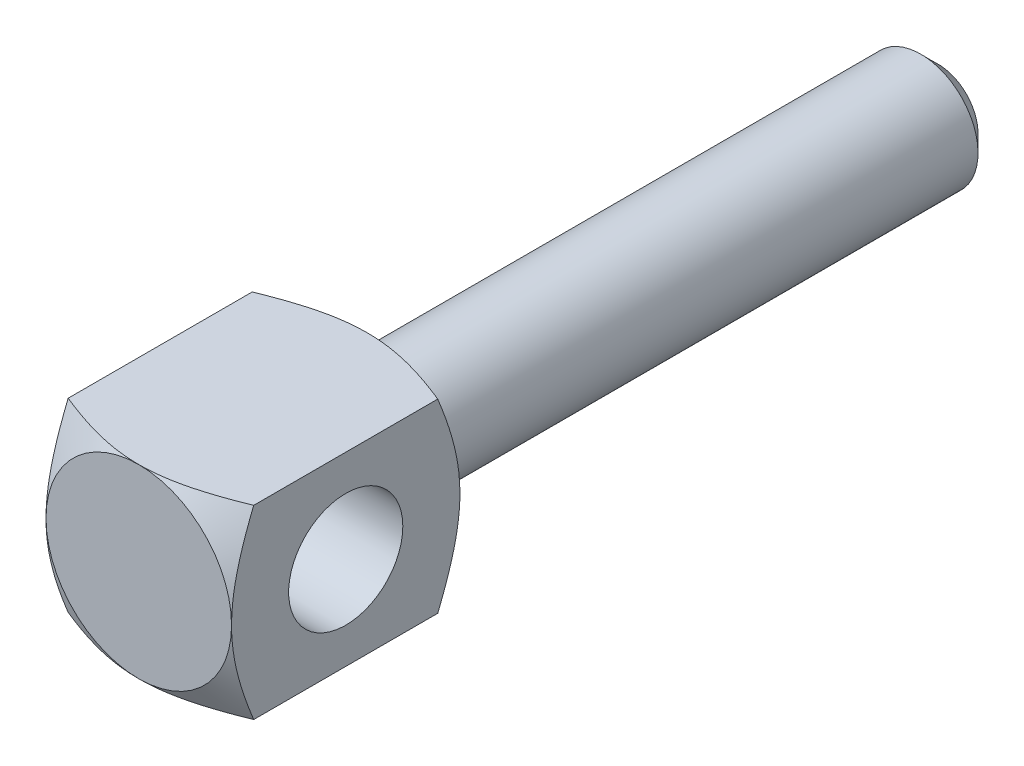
ISO-10303-21;
HEADER;
FILE_DESCRIPTION(('STEP AP214'),'2;1');
FILE_NAME('part.step','',(''),(''),'','','');
FILE_SCHEMA(('AUTOMOTIVE_DESIGN { 1 0 10303 214 1 1 1 1 }'));
ENDSEC;
DATA;
#1=APPLICATION_CONTEXT('core data for automotive mechanical design processes');
#2=APPLICATION_PROTOCOL_DEFINITION('international standard','automotive_design',2000,#1);
#3=PRODUCT_CONTEXT('',#1,'mechanical');
#4=PRODUCT('Part','Part','',(#3));
#5=PRODUCT_RELATED_PRODUCT_CATEGORY('part','',(#4));
#6=PRODUCT_DEFINITION_FORMATION('','',#4);
#7=PRODUCT_DEFINITION_CONTEXT('part definition',#1,'design');
#8=PRODUCT_DEFINITION('design','',#6,#7);
#9=PRODUCT_DEFINITION_SHAPE('','',#8);
#10=(LENGTH_UNIT() NAMED_UNIT(*) SI_UNIT(.MILLI.,.METRE.));
#11=(NAMED_UNIT(*) PLANE_ANGLE_UNIT() SI_UNIT($,.RADIAN.));
#12=(NAMED_UNIT(*) SI_UNIT($,.STERADIAN.) SOLID_ANGLE_UNIT());
#13=UNCERTAINTY_MEASURE_WITH_UNIT(LENGTH_MEASURE(1.E-05),#10,'distance_accuracy_value','');
#14=(GEOMETRIC_REPRESENTATION_CONTEXT(3) GLOBAL_UNCERTAINTY_ASSIGNED_CONTEXT((#13)) GLOBAL_UNIT_ASSIGNED_CONTEXT((#10,
#11,#12)) REPRESENTATION_CONTEXT('',''));
#15=CARTESIAN_POINT('',(0.,0.,0.));
#16=DIRECTION('',(0.,0.,1.));
#17=DIRECTION('',(1.,0.,0.));
#18=AXIS2_PLACEMENT_3D('',#15,#16,#17);
#19=CARTESIAN_POINT('',(0.,-4.,40.));
#20=DIRECTION('',(0.,0.,1.));
#21=DIRECTION('',(0.,-1.,0.));
#22=AXIS2_PLACEMENT_3D('',#19,#20,#21);
#23=PLANE('',#22);
#24=CARTESIAN_POINT('',(0.,0.,40.));
#25=DIRECTION('',(0.,0.,1.));
#26=DIRECTION('',(0.,-1.,0.));
#27=AXIS2_PLACEMENT_3D('',#24,#25,#26);
#28=CIRCLE('',#27,4.);
#29=CARTESIAN_POINT('',(0.,-4.,40.));
#30=VERTEX_POINT('',#29);
#31=EDGE_CURVE('E191',#30,#30,#28,.T.);
#32=ORIENTED_EDGE('',*,*,#31,.T.);
#33=EDGE_LOOP('',(#32));
#34=FACE_BOUND('',#33,.T.);
#35=CARTESIAN_POINT('',(0.,0.,40.));
#36=DIRECTION('',(0.,0.,1.));
#37=DIRECTION('',(0.,-1.,0.));
#38=AXIS2_PLACEMENT_3D('',#35,#36,#37);
#39=CIRCLE('',#38,6.5);
#40=CARTESIAN_POINT('',(0.,-6.5,40.));
#41=VERTEX_POINT('',#40);
#42=CARTESIAN_POINT('',(6.5,0.,40.));
#43=VERTEX_POINT('',#42);
#44=EDGE_CURVE('E82',#41,#43,#39,.T.);
#45=ORIENTED_EDGE('',*,*,#44,.F.);
#46=CARTESIAN_POINT('',(0.,0.,40.));
#47=DIRECTION('',(0.,0.,1.));
#48=DIRECTION('',(0.,-1.,0.));
#49=AXIS2_PLACEMENT_3D('',#46,#47,#48);
#50=CIRCLE('',#49,6.5);
#51=CARTESIAN_POINT('',(-6.5,0.,40.));
#52=VERTEX_POINT('',#51);
#53=EDGE_CURVE('E18',#52,#41,#50,.T.);
#54=ORIENTED_EDGE('',*,*,#53,.F.);
#55=CARTESIAN_POINT('',(0.,6.5,40.));
#56=VERTEX_POINT('',#55);
#57=EDGE_CURVE('E23',#56,#52,#50,.T.);
#58=ORIENTED_EDGE('',*,*,#57,.F.);
#59=EDGE_CURVE('E9',#43,#56,#50,.T.);
#60=ORIENTED_EDGE('',*,*,#59,.F.);
#61=EDGE_LOOP('',(#45,#54,#58,#60));
#62=FACE_BOUND('',#61,.T.);
#63=ADVANCED_FACE('F14',(#34,#62),#23,.F.);
#64=CARTESIAN_POINT('',(0.,0.,0.));
#65=DIRECTION('',(0.,0.,1.));
#66=DIRECTION('',(0.,-1.,0.));
#67=AXIS2_PLACEMENT_3D('',#64,#65,#66);
#68=PLANE('',#67);
#69=CARTESIAN_POINT('',(0.,0.,0.));
#70=DIRECTION('',(0.,0.,1.));
#71=DIRECTION('',(0.,-1.,0.));
#72=AXIS2_PLACEMENT_3D('',#69,#70,#71);
#73=CIRCLE('',#72,2.8);
#74=CARTESIAN_POINT('',(0.,-2.8,0.));
#75=VERTEX_POINT('',#74);
#76=EDGE_CURVE('E197',#75,#75,#73,.T.);
#77=ORIENTED_EDGE('',*,*,#76,.F.);
#78=EDGE_LOOP('',(#77));
#79=FACE_BOUND('',#78,.T.);
#80=ADVANCED_FACE('F16',(#79),#68,.F.);
#81=CARTESIAN_POINT('',(0.,0.,1.2));
#82=DIRECTION('',(0.,0.,1.));
#83=DIRECTION('',(0.,-1.,0.));
#84=AXIS2_PLACEMENT_3D('',#81,#82,#83);
#85=CONICAL_SURFACE('',#84,4.,0.785398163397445);
#86=ORIENTED_EDGE('',*,*,#76,.T.);
#87=EDGE_LOOP('',(#86));
#88=FACE_BOUND('',#87,.T.);
#89=CARTESIAN_POINT('',(0.,0.,1.2));
#90=DIRECTION('',(0.,0.,1.));
#91=DIRECTION('',(0.,-1.,0.));
#92=AXIS2_PLACEMENT_3D('',#89,#90,#91);
#93=CIRCLE('',#92,4.);
#94=CARTESIAN_POINT('',(0.,-4.,1.2));
#95=VERTEX_POINT('',#94);
#96=EDGE_CURVE('E194',#95,#95,#93,.T.);
#97=ORIENTED_EDGE('',*,*,#96,.F.);
#98=EDGE_LOOP('',(#97));
#99=FACE_BOUND('',#98,.T.);
#100=ADVANCED_FACE('F251',(#88,#99),#85,.T.);
#101=CARTESIAN_POINT('',(0.,0.,140.));
#102=DIRECTION('',(0.,0.,1.));
#103=DIRECTION('',(0.,-1.,0.));
#104=AXIS2_PLACEMENT_3D('',#101,#102,#103);
#105=CYLINDRICAL_SURFACE('',#104,4.);
#106=ORIENTED_EDGE('',*,*,#31,.F.);
#107=EDGE_LOOP('',(#106));
#108=FACE_BOUND('',#107,.T.);
#109=ORIENTED_EDGE('',*,*,#96,.T.);
#110=EDGE_LOOP('',(#109));
#111=FACE_BOUND('',#110,.T.);
#112=ADVANCED_FACE('F254',(#108,#111),#105,.T.);
#113=CARTESIAN_POINT('',(0.,0.,43.3053832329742));
#114=DIRECTION('',(0.,0.,1.));
#115=DIRECTION('',(0.,-1.,0.));
#116=AXIS2_PLACEMENT_3D('',#113,#114,#115);
#117=CONICAL_SURFACE('',#116,12.2250916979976,1.0471975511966);
#118=CARTESIAN_POINT('',(-13.170806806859,-6.5,44.7270061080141));
#119=CARTESIAN_POINT('',(-12.8513212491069,-6.5,44.5616223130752));
#120=CARTESIAN_POINT('',(-12.531370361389,-6.5,44.3971290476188));
#121=CARTESIAN_POINT('',(-11.8902968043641,-6.5,44.0703971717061));
#122=CARTESIAN_POINT('',(-11.5691740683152,-6.5,43.9081586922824));
#123=CARTESIAN_POINT('',(-10.9248596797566,-6.5,43.5860828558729));
#124=CARTESIAN_POINT('',(-10.6016650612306,-6.5,43.4262514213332));
#125=CARTESIAN_POINT('',(-9.95360392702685,-6.5,43.1100264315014));
#126=CARTESIAN_POINT('',(-9.6287374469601,-6.5,42.9536328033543));
#127=CARTESIAN_POINT('',(-8.95837578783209,-6.5,42.6363684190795));
#128=CARTESIAN_POINT('',(-8.61276045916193,-6.5,42.4757507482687));
#129=CARTESIAN_POINT('',(-7.91866608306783,-6.5,42.1607447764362));
#130=CARTESIAN_POINT('',(-7.57018686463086,-6.5,42.0063568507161));
#131=CARTESIAN_POINT('',(-6.86996890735,-6.5,41.7059043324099));
#132=CARTESIAN_POINT('',(-6.51823300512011,-6.5,41.5598331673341));
#133=CARTESIAN_POINT('',(-5.81043935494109,-6.5,41.2786319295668));
#134=CARTESIAN_POINT('',(-5.4543822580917,-6.5,41.1435002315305));
#135=CARTESIAN_POINT('',(-4.74112513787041,-6.5,40.8894360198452));
#136=CARTESIAN_POINT('',(-4.38398639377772,-6.5,40.7703336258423));
#137=CARTESIAN_POINT('',(-3.66372876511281,-6.5,40.5514514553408));
#138=CARTESIAN_POINT('',(-3.30060960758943,-6.5,40.4516725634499));
#139=CARTESIAN_POINT('',(-2.57544214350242,-6.5,40.279438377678));
#140=CARTESIAN_POINT('',(-2.21351869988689,-6.5,40.2064747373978));
#141=CARTESIAN_POINT('',(-1.66702381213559,-6.5,40.1201289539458));
#142=CARTESIAN_POINT('',(-1.484252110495,-6.5,40.0951966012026));
#143=CARTESIAN_POINT('',(-1.1177718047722,-6.5,40.053671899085));
#144=CARTESIAN_POINT('',(-0.934063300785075,-6.5,40.037078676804));
#145=CARTESIAN_POINT('',(-0.522805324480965,-6.5,40.0098650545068));
#146=CARTESIAN_POINT('',(-0.295097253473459,-6.5,40.0015642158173));
#147=CARTESIAN_POINT('',(0.160406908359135,-6.5,39.9988386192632));
#148=CARTESIAN_POINT('',(0.388203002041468,-6.5,40.0044143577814));
#149=CARTESIAN_POINT('',(0.843089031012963,-6.5,40.0291762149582));
#150=CARTESIAN_POINT('',(1.07017882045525,-6.5,40.0483649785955));
#151=CARTESIAN_POINT('',(1.52290639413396,-6.5,40.0994923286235));
#152=CARTESIAN_POINT('',(1.74854412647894,-6.5,40.1314313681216));
#153=CARTESIAN_POINT('',(2.20428872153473,-6.5,40.2078615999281));
#154=CARTESIAN_POINT('',(2.43433924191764,-6.5,40.2526851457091));
#155=CARTESIAN_POINT('',(2.89211105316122,-6.5,40.3528868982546));
#156=CARTESIAN_POINT('',(3.11983228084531,-6.5,40.4082653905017));
#157=CARTESIAN_POINT('',(3.57301250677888,-6.5,40.5280247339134));
#158=CARTESIAN_POINT('',(3.79847016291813,-6.5,40.5924106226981));
#159=CARTESIAN_POINT('',(4.24706573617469,-6.5,40.7287122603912));
#160=CARTESIAN_POINT('',(4.47020378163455,-6.5,40.8006275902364));
#161=CARTESIAN_POINT('',(5.08998498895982,-6.5,41.0100529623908));
#162=CARTESIAN_POINT('',(5.48429388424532,-6.5,41.1544621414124));
#163=CARTESIAN_POINT('',(6.26737962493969,-6.5,41.4576558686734));
#164=CARTESIAN_POINT('',(6.65615488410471,-6.5,41.6164444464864));
#165=CARTESIAN_POINT('',(7.4296178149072,-6.5,41.9446033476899));
#166=CARTESIAN_POINT('',(7.8143013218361,-6.5,42.1139834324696));
#167=CARTESIAN_POINT('',(8.58012081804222,-6.5,42.4604337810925));
#168=CARTESIAN_POINT('',(8.96125717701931,-6.5,42.6375032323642));
#169=CARTESIAN_POINT('',(9.72196205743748,-6.5,42.998007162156));
#170=CARTESIAN_POINT('',(10.101521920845,-6.5,43.1814598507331));
#171=CARTESIAN_POINT('',(10.8584497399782,-6.5,43.5528416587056));
#172=CARTESIAN_POINT('',(11.2358176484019,-6.5,43.7407708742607));
#173=CARTESIAN_POINT('',(11.988592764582,-6.5,44.1200158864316));
#174=CARTESIAN_POINT('',(12.3640009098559,-6.5,44.3113298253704));
#175=CARTESIAN_POINT('',(13.1133899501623,-6.5,44.6967216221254));
#176=CARTESIAN_POINT('',(13.4873708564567,-6.5,44.8907994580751));
#177=CARTESIAN_POINT('',(14.5067202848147,-6.5,45.4236307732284));
#178=CARTESIAN_POINT('',(15.150936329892,-6.5,45.7645880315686));
#179=CARTESIAN_POINT('',(16.4369696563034,-6.5,46.4512157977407));
#180=CARTESIAN_POINT('',(17.0787865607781,-6.5,46.796887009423));
#181=CARTESIAN_POINT('',(18.3563784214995,-6.5,47.4893845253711));
#182=CARTESIAN_POINT('',(18.9921654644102,-6.5,47.8361885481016));
#183=CARTESIAN_POINT('',(19.9447415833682,-6.5,48.3582763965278));
#184=CARTESIAN_POINT('',(20.2620554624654,-6.5,48.5326041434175));
#185=CARTESIAN_POINT('',(20.8963727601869,-6.5,48.8818223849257));
#186=CARTESIAN_POINT('',(21.2133761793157,-6.5,49.0567128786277));
#187=CARTESIAN_POINT('',(21.5302445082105,-6.5,49.2318478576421));
#188=B_SPLINE_CURVE_WITH_KNOTS('',3,(#118,#119,#120,#121,#122,#123,#124,#125,#126,#127,#128,
#129,#130,#131,#132,#133,#134,#135,#136,#137,#138,#139,#140,#141,#142,#143,#144,#145,#146,#147,
#148,#149,#150,#151,#152,#153,#154,#155,#156,#157,#158,#159,#160,#161,#162,#163,#164,#165,#166,
#167,#168,#169,#170,#171,#172,#173,#174,#175,#176,#177,#178,#179,#180,#181,#182,#183,#184,#185,
#186,#187),.UNSPECIFIED.,.F.,.F.,(4,2,2,2,2,2,2,2,2,2,2,2,2,2,2,2,2,2,2,2,2,2,2,2,2,2,2,2,2,2,2,
2,2,2,4),(0.,1.07926585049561,2.15859416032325,3.24024653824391,4.32187597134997,
5.46517113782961,6.6085350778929,7.75098253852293,8.89325994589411,10.022273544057,
11.1513388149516,12.2577363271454,12.8109657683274,13.3641372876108,14.0472875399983,
14.7304622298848,15.4137696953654,16.0971014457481,16.7999437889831,17.5028051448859,
18.2060611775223,18.9092780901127,20.1685968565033,21.428269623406,22.6891209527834,
23.9498393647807,25.2145091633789,26.4792061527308,27.7432293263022,29.0072425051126,
31.1938518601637,33.3807913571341,35.553450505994,36.6395920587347,37.7257318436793),.UNSPECIFIED.);
#189=CARTESIAN_POINT('',(-6.5,-6.5,41.5544510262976));
#190=VERTEX_POINT('',#189);
#191=EDGE_CURVE('E89',#41,#190,#188,.F.);
#192=ORIENTED_EDGE('',*,*,#191,.T.);
#193=CARTESIAN_POINT('',(-6.5,13.170806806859,44.7270061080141));
#194=CARTESIAN_POINT('',(-6.5,12.8513212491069,44.5616223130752));
#195=CARTESIAN_POINT('',(-6.5,12.531370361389,44.3971290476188));
#196=CARTESIAN_POINT('',(-6.5,11.8902968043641,44.0703971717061));
#197=CARTESIAN_POINT('',(-6.5,11.5691740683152,43.9081586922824));
#198=CARTESIAN_POINT('',(-6.5,10.9248596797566,43.5860828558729));
#199=CARTESIAN_POINT('',(-6.5,10.6016650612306,43.4262514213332));
#200=CARTESIAN_POINT('',(-6.5,9.95360392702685,43.1100264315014));
#201=CARTESIAN_POINT('',(-6.5,9.62873744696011,42.9536328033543));
#202=CARTESIAN_POINT('',(-6.5,8.9583757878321,42.6363684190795));
#203=CARTESIAN_POINT('',(-6.5,8.61276045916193,42.4757507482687));
#204=CARTESIAN_POINT('',(-6.5,7.91866608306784,42.1607447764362));
#205=CARTESIAN_POINT('',(-6.5,7.57018686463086,42.0063568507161));
#206=CARTESIAN_POINT('',(-6.5,6.86996890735,41.7059043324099));
#207=CARTESIAN_POINT('',(-6.5,6.51823300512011,41.5598331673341));
#208=CARTESIAN_POINT('',(-6.5,5.8104393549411,41.2786319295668));
#209=CARTESIAN_POINT('',(-6.5,5.4543822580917,41.1435002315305));
#210=CARTESIAN_POINT('',(-6.5,4.74112513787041,40.8894360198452));
#211=CARTESIAN_POINT('',(-6.5,4.38398639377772,40.7703336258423));
#212=CARTESIAN_POINT('',(-6.5,3.66372876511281,40.5514514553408));
#213=CARTESIAN_POINT('',(-6.5,3.30060960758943,40.4516725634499));
#214=CARTESIAN_POINT('',(-6.5,2.57544214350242,40.279438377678));
#215=CARTESIAN_POINT('',(-6.5,2.21351869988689,40.2064747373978));
#216=CARTESIAN_POINT('',(-6.5,1.66702381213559,40.1201289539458));
#217=CARTESIAN_POINT('',(-6.5,1.484252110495,40.0951966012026));
#218=CARTESIAN_POINT('',(-6.5,1.1177718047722,40.053671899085));
#219=CARTESIAN_POINT('',(-6.5,0.934063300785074,40.037078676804));
#220=CARTESIAN_POINT('',(-6.5,0.522805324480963,40.0098650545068));
#221=CARTESIAN_POINT('',(-6.5,0.295097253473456,40.0015642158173));
#222=CARTESIAN_POINT('',(-6.5,-0.16040690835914,39.9988386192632));
#223=CARTESIAN_POINT('',(-6.5,-0.388203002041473,40.0044143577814));
#224=CARTESIAN_POINT('',(-6.5,-0.843089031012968,40.0291762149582));
#225=CARTESIAN_POINT('',(-6.5,-1.07017882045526,40.0483649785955));
#226=CARTESIAN_POINT('',(-6.5,-1.52290639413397,40.0994923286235));
#227=CARTESIAN_POINT('',(-6.5,-1.74854412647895,40.1314313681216));
#228=CARTESIAN_POINT('',(-6.5,-2.20428872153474,40.2078615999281));
#229=CARTESIAN_POINT('',(-6.5,-2.43433924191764,40.2526851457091));
#230=CARTESIAN_POINT('',(-6.5,-2.89211105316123,40.3528868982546));
#231=CARTESIAN_POINT('',(-6.5,-3.11983228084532,40.4082653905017));
#232=CARTESIAN_POINT('',(-6.5,-3.57301250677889,40.5280247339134));
#233=CARTESIAN_POINT('',(-6.5,-3.79847016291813,40.5924106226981));
#234=CARTESIAN_POINT('',(-6.5,-4.2470657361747,40.7287122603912));
#235=CARTESIAN_POINT('',(-6.5,-4.47020378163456,40.8006275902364));
#236=CARTESIAN_POINT('',(-6.5,-5.08998498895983,41.0100529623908));
#237=CARTESIAN_POINT('',(-6.5,-5.48429388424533,41.1544621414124));
#238=CARTESIAN_POINT('',(-6.5,-6.2673796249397,41.4576558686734));
#239=CARTESIAN_POINT('',(-6.5,-6.65615488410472,41.6164444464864));
#240=CARTESIAN_POINT('',(-6.5,-7.42961781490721,41.9446033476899));
#241=CARTESIAN_POINT('',(-6.5,-7.81430132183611,42.1139834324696));
#242=CARTESIAN_POINT('',(-6.5,-8.58012081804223,42.4604337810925));
#243=CARTESIAN_POINT('',(-6.5,-8.96125717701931,42.6375032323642));
#244=CARTESIAN_POINT('',(-6.5,-9.72196205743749,42.998007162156));
#245=CARTESIAN_POINT('',(-6.5,-10.101521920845,43.1814598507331));
#246=CARTESIAN_POINT('',(-6.5,-10.8584497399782,43.5528416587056));
#247=CARTESIAN_POINT('',(-6.5,-11.2358176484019,43.7407708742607));
#248=CARTESIAN_POINT('',(-6.5,-11.988592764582,44.1200158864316));
#249=CARTESIAN_POINT('',(-6.5,-12.3640009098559,44.3113298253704));
#250=CARTESIAN_POINT('',(-6.5,-13.1133899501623,44.6967216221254));
#251=CARTESIAN_POINT('',(-6.5,-13.4873708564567,44.8907994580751));
#252=CARTESIAN_POINT('',(-6.5,-14.5067202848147,45.4236307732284));
#253=CARTESIAN_POINT('',(-6.5,-15.150936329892,45.7645880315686));
#254=CARTESIAN_POINT('',(-6.5,-16.4369696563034,46.4512157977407));
#255=CARTESIAN_POINT('',(-6.5,-17.0787865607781,46.796887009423));
#256=CARTESIAN_POINT('',(-6.5,-18.3563784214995,47.4893845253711));
#257=CARTESIAN_POINT('',(-6.5,-18.9921654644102,47.8361885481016));
#258=CARTESIAN_POINT('',(-6.5,-19.9447415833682,48.3582763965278));
#259=CARTESIAN_POINT('',(-6.5,-20.2620554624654,48.5326041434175));
#260=CARTESIAN_POINT('',(-6.5,-20.8963727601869,48.8818223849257));
#261=CARTESIAN_POINT('',(-6.5,-21.2133761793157,49.0567128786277));
#262=CARTESIAN_POINT('',(-6.5,-21.5302445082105,49.2318478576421));
#263=B_SPLINE_CURVE_WITH_KNOTS('',3,(#193,#194,#195,#196,#197,#198,#199,#200,#201,#202,#203,
#204,#205,#206,#207,#208,#209,#210,#211,#212,#213,#214,#215,#216,#217,#218,#219,#220,#221,#222,
#223,#224,#225,#226,#227,#228,#229,#230,#231,#232,#233,#234,#235,#236,#237,#238,#239,#240,#241,
#242,#243,#244,#245,#246,#247,#248,#249,#250,#251,#252,#253,#254,#255,#256,#257,#258,#259,#260,
#261,#262),.UNSPECIFIED.,.F.,.F.,(4,2,2,2,2,2,2,2,2,2,2,2,2,2,2,2,2,2,2,2,2,2,2,2,2,2,2,2,2,2,2,
2,2,2,4),(0.,1.07926585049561,2.15859416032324,3.24024653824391,4.32187597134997,
5.4651711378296,6.6085350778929,7.75098253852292,8.89325994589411,10.022273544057,
11.1513388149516,12.2577363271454,12.8109657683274,13.3641372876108,14.0472875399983,
14.7304622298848,15.4137696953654,16.0971014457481,16.7999437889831,17.5028051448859,
18.2060611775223,18.9092780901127,20.1685968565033,21.428269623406,22.6891209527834,
23.9498393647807,25.214509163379,26.4792061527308,27.7432293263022,29.0072425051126,
31.1938518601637,33.3807913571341,35.553450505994,36.6395920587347,37.7257318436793),.UNSPECIFIED.);
#264=EDGE_CURVE('E96',#52,#190,#263,.T.);
#265=ORIENTED_EDGE('',*,*,#264,.F.);
#266=ORIENTED_EDGE('',*,*,#53,.T.);
#267=EDGE_LOOP('',(#192,#265,#266));
#268=FACE_BOUND('',#267,.T.);
#269=ADVANCED_FACE('F94',(#268),#117,.T.);
#270=ORIENTED_EDGE('',*,*,#57,.T.);
#271=CARTESIAN_POINT('',(-6.5,6.5,41.5544510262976));
#272=VERTEX_POINT('',#271);
#273=EDGE_CURVE('E106',#272,#52,#263,.T.);
#274=ORIENTED_EDGE('',*,*,#273,.F.);
#275=CARTESIAN_POINT('',(-13.17080681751,6.5,44.7270061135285));
#276=CARTESIAN_POINT('',(-12.8513212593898,6.5,44.5616223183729));
#277=CARTESIAN_POINT('',(-12.5313703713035,6.5,44.3971290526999));
#278=CARTESIAN_POINT('',(-11.8902968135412,6.5,44.070397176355));
#279=CARTESIAN_POINT('',(-11.5691740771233,6.5,43.9081586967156));
#280=CARTESIAN_POINT('',(-10.9248596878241,6.5,43.5860828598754));
#281=CARTESIAN_POINT('',(-10.6016650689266,6.5,43.4262514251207));
#282=CARTESIAN_POINT('',(-9.95360393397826,6.5,43.1100264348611));
#283=CARTESIAN_POINT('',(-9.6287374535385,6.5,42.9536328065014));
#284=CARTESIAN_POINT('',(-8.95837579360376,6.5,42.6363684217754));
#285=CARTESIAN_POINT('',(-8.61276046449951,6.5,42.4757507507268));
#286=CARTESIAN_POINT('',(-7.91866608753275,6.5,42.1607447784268));
#287=CARTESIAN_POINT('',(-7.5701868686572,6.5,42.0063568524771));
#288=CARTESIAN_POINT('',(-6.86996891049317,6.5,41.7059043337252));
#289=CARTESIAN_POINT('',(-6.5182330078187,6.5,41.5598331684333));
#290=CARTESIAN_POINT('',(-5.81043935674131,6.5,41.278631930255));
#291=CARTESIAN_POINT('',(-5.45438225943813,6.5,41.1435002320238));
#292=CARTESIAN_POINT('',(-4.74112513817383,6.5,40.8894360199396));
#293=CARTESIAN_POINT('',(-4.38398639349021,6.5,40.7703336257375));
#294=CARTESIAN_POINT('',(-3.66372876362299,6.5,40.5514514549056));
#295=CARTESIAN_POINT('',(-3.30060960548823,6.5,40.4516725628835));
#296=CARTESIAN_POINT('',(-2.57544214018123,6.5,40.2794383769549));
#297=CARTESIAN_POINT('',(-2.21351869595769,6.5,40.2064747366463));
#298=CARTESIAN_POINT('',(-1.66702380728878,6.5,40.1201289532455));
#299=CARTESIAN_POINT('',(-1.48425210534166,6.5,40.0951966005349));
#300=CARTESIAN_POINT('',(-1.11777179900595,6.5,40.0536718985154));
#301=CARTESIAN_POINT('',(-0.934063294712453,6.5,40.0370786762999));
#302=CARTESIAN_POINT('',(-0.522805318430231,6.5,40.0098650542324));
#303=CARTESIAN_POINT('',(-0.29509724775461,6.5,40.0015642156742));
#304=CARTESIAN_POINT('',(0.160406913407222,6.5,39.9988386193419));
#305=CARTESIAN_POINT('',(0.388203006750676,6.5,40.0044143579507));
#306=CARTESIAN_POINT('',(0.843089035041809,6.5,40.0291762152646));
#307=CARTESIAN_POINT('',(1.07017882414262,6.5,40.0483649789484));
#308=CARTESIAN_POINT('',(1.5229063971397,6.5,40.0994923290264));
#309=CARTESIAN_POINT('',(1.74854412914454,6.5,40.1314313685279));
#310=CARTESIAN_POINT('',(2.2042887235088,6.5,40.207861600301));
#311=CARTESIAN_POINT('',(2.43433924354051,6.5,40.2526851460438));
#312=CARTESIAN_POINT('',(2.89211105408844,6.5,40.3528868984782));
#313=CARTESIAN_POINT('',(3.11983228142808,6.5,40.4082653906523));
#314=CARTESIAN_POINT('',(3.57301250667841,6.5,40.5280247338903));
#315=CARTESIAN_POINT('',(3.79847016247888,6.5,40.5924106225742));
#316=CARTESIAN_POINT('',(4.24706573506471,6.5,40.7287122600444));
#317=CARTESIAN_POINT('',(4.47020378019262,6.5,40.8006275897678));
#318=CARTESIAN_POINT('',(5.08998498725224,6.5,41.0100529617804));
#319=CARTESIAN_POINT('',(5.48429388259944,6.5,41.1544621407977));
#320=CARTESIAN_POINT('',(6.26737962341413,6.5,41.4576558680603));
#321=CARTESIAN_POINT('',(6.65615488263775,6.5,41.6164444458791));
#322=CARTESIAN_POINT('',(7.42961781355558,6.5,41.9446033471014));
#323=CARTESIAN_POINT('',(7.81430132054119,6.5,42.1139834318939));
#324=CARTESIAN_POINT('',(8.5801208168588,6.5,42.460433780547));
#325=CARTESIAN_POINT('',(8.96125717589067,6.5,42.6375032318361));
#326=CARTESIAN_POINT('',(9.72196205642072,6.5,42.9980071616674));
#327=CARTESIAN_POINT('',(10.1015219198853,6.5,43.1814598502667));
#328=CARTESIAN_POINT('',(10.8584497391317,6.5,43.5528416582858));
#329=CARTESIAN_POINT('',(11.2358176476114,6.5,43.7407708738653));
#330=CARTESIAN_POINT('',(11.9885927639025,6.5,44.1200158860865));
#331=CARTESIAN_POINT('',(12.3640009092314,6.5,44.3113298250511));
#332=CARTESIAN_POINT('',(13.1133899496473,6.5,44.6967216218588));
#333=CARTESIAN_POINT('',(13.4873708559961,6.5,44.8907994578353));
#334=CARTESIAN_POINT('',(14.5067202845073,6.5,45.4236307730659));
#335=CARTESIAN_POINT('',(15.150936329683,6.5,45.7645880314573));
#336=CARTESIAN_POINT('',(16.4369696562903,6.5,46.4512157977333));
#337=CARTESIAN_POINT('',(17.0787865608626,6.5,46.7968870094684));
#338=CARTESIAN_POINT('',(18.3563784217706,6.5,47.4893845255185));
#339=CARTESIAN_POINT('',(18.9921654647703,6.5,47.8361885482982));
#340=CARTESIAN_POINT('',(19.9447415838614,6.5,48.3582763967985));
#341=CARTESIAN_POINT('',(20.2620554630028,6.5,48.532604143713));
#342=CARTESIAN_POINT('',(20.8963727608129,6.5,48.8818223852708));
#343=CARTESIAN_POINT('',(21.2133761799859,6.5,49.0567128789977));
#344=CARTESIAN_POINT('',(21.5302445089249,6.5,49.231847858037));
#345=B_SPLINE_CURVE_WITH_KNOTS('',3,(#275,#276,#277,#278,#279,#280,#281,#282,#283,#284,#285,
#286,#287,#288,#289,#290,#291,#292,#293,#294,#295,#296,#297,#298,#299,#300,#301,#302,#303,#304,
#305,#306,#307,#308,#309,#310,#311,#312,#313,#314,#315,#316,#317,#318,#319,#320,#321,#322,#323,
#324,#325,#326,#327,#328,#329,#330,#331,#332,#333,#334,#335,#336,#337,#338,#339,#340,#341,#342,
#343,#344),.UNSPECIFIED.,.F.,.F.,(4,2,2,2,2,2,2,2,2,2,2,2,2,2,2,2,2,2,2,2,2,2,2,2,2,2,2,2,2,2,2,
2,2,2,4),(0.,1.07926585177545,2.158594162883,3.24024654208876,4.32187597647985,5.46517114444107,
6.60853508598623,7.75098254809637,8.89325995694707,10.0222735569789,11.1513388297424,
12.2577363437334,12.8109657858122,13.3641373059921,14.0472875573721,14.7304622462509,
15.4137697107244,16.0971014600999,16.7999438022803,17.5028051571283,18.206061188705,
18.9092781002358,20.1685968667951,21.4282696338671,22.6891209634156,23.9498393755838,
25.2145091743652,26.4792061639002,27.7432293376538,29.0072425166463,31.1938518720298,
33.3807913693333,35.5534505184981,36.639592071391,37.7257318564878),.UNSPECIFIED.);
#346=EDGE_CURVE('E37',#56,#272,#345,.F.);
#347=ORIENTED_EDGE('',*,*,#346,.F.);
#348=EDGE_LOOP('',(#270,#274,#347));
#349=FACE_BOUND('',#348,.T.);
#350=ADVANCED_FACE('F126',(#349),#117,.T.);
#351=CARTESIAN_POINT('',(6.5,13.170806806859,44.7270061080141));
#352=CARTESIAN_POINT('',(6.5,12.8513212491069,44.5616223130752));
#353=CARTESIAN_POINT('',(6.5,12.531370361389,44.3971290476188));
#354=CARTESIAN_POINT('',(6.5,11.8902968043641,44.0703971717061));
#355=CARTESIAN_POINT('',(6.5,11.5691740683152,43.9081586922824));
#356=CARTESIAN_POINT('',(6.5,10.9248596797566,43.5860828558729));
#357=CARTESIAN_POINT('',(6.5,10.6016650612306,43.4262514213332));
#358=CARTESIAN_POINT('',(6.5,9.95360392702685,43.1100264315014));
#359=CARTESIAN_POINT('',(6.5,9.62873744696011,42.9536328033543));
#360=CARTESIAN_POINT('',(6.5,8.9583757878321,42.6363684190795));
#361=CARTESIAN_POINT('',(6.5,8.61276045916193,42.4757507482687));
#362=CARTESIAN_POINT('',(6.5,7.91866608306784,42.1607447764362));
#363=CARTESIAN_POINT('',(6.5,7.57018686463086,42.0063568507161));
#364=CARTESIAN_POINT('',(6.5,6.86996890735,41.7059043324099));
#365=CARTESIAN_POINT('',(6.5,6.51823300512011,41.5598331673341));
#366=CARTESIAN_POINT('',(6.5,5.8104393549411,41.2786319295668));
#367=CARTESIAN_POINT('',(6.5,5.4543822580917,41.1435002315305));
#368=CARTESIAN_POINT('',(6.5,4.74112513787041,40.8894360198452));
#369=CARTESIAN_POINT('',(6.5,4.38398639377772,40.7703336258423));
#370=CARTESIAN_POINT('',(6.5,3.66372876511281,40.5514514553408));
#371=CARTESIAN_POINT('',(6.5,3.30060960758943,40.4516725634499));
#372=CARTESIAN_POINT('',(6.5,2.57544214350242,40.279438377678));
#373=CARTESIAN_POINT('',(6.5,2.21351869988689,40.2064747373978));
#374=CARTESIAN_POINT('',(6.5,1.66702381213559,40.1201289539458));
#375=CARTESIAN_POINT('',(6.5,1.484252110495,40.0951966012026));
#376=CARTESIAN_POINT('',(6.5,1.1177718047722,40.053671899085));
#377=CARTESIAN_POINT('',(6.5,0.934063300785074,40.037078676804));
#378=CARTESIAN_POINT('',(6.5,0.522805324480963,40.0098650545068));
#379=CARTESIAN_POINT('',(6.5,0.295097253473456,40.0015642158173));
#380=CARTESIAN_POINT('',(6.5,-0.16040690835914,39.9988386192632));
#381=CARTESIAN_POINT('',(6.5,-0.388203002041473,40.0044143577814));
#382=CARTESIAN_POINT('',(6.5,-0.843089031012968,40.0291762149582));
#383=CARTESIAN_POINT('',(6.5,-1.07017882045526,40.0483649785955));
#384=CARTESIAN_POINT('',(6.5,-1.52290639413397,40.0994923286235));
#385=CARTESIAN_POINT('',(6.5,-1.74854412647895,40.1314313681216));
#386=CARTESIAN_POINT('',(6.5,-2.20428872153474,40.2078615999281));
#387=CARTESIAN_POINT('',(6.5,-2.43433924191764,40.2526851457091));
#388=CARTESIAN_POINT('',(6.5,-2.89211105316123,40.3528868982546));
#389=CARTESIAN_POINT('',(6.5,-3.11983228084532,40.4082653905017));
#390=CARTESIAN_POINT('',(6.5,-3.57301250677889,40.5280247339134));
#391=CARTESIAN_POINT('',(6.5,-3.79847016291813,40.5924106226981));
#392=CARTESIAN_POINT('',(6.5,-4.2470657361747,40.7287122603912));
#393=CARTESIAN_POINT('',(6.5,-4.47020378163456,40.8006275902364));
#394=CARTESIAN_POINT('',(6.5,-5.08998498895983,41.0100529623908));
#395=CARTESIAN_POINT('',(6.5,-5.48429388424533,41.1544621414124));
#396=CARTESIAN_POINT('',(6.5,-6.2673796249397,41.4576558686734));
#397=CARTESIAN_POINT('',(6.5,-6.65615488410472,41.6164444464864));
#398=CARTESIAN_POINT('',(6.5,-7.42961781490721,41.9446033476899));
#399=CARTESIAN_POINT('',(6.5,-7.81430132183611,42.1139834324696));
#400=CARTESIAN_POINT('',(6.5,-8.58012081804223,42.4604337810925));
#401=CARTESIAN_POINT('',(6.5,-8.96125717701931,42.6375032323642));
#402=CARTESIAN_POINT('',(6.5,-9.72196205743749,42.998007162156));
#403=CARTESIAN_POINT('',(6.5,-10.101521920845,43.1814598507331));
#404=CARTESIAN_POINT('',(6.5,-10.8584497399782,43.5528416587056));
#405=CARTESIAN_POINT('',(6.5,-11.2358176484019,43.7407708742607));
#406=CARTESIAN_POINT('',(6.5,-11.988592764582,44.1200158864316));
#407=CARTESIAN_POINT('',(6.5,-12.3640009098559,44.3113298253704));
#408=CARTESIAN_POINT('',(6.5,-13.1133899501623,44.6967216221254));
#409=CARTESIAN_POINT('',(6.5,-13.4873708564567,44.8907994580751));
#410=CARTESIAN_POINT('',(6.5,-14.5067202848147,45.4236307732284));
#411=CARTESIAN_POINT('',(6.5,-15.150936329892,45.7645880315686));
#412=CARTESIAN_POINT('',(6.5,-16.4369696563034,46.4512157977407));
#413=CARTESIAN_POINT('',(6.5,-17.0787865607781,46.796887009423));
#414=CARTESIAN_POINT('',(6.5,-18.3563784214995,47.4893845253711));
#415=CARTESIAN_POINT('',(6.5,-18.9921654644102,47.8361885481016));
#416=CARTESIAN_POINT('',(6.5,-19.9447415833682,48.3582763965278));
#417=CARTESIAN_POINT('',(6.5,-20.2620554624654,48.5326041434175));
#418=CARTESIAN_POINT('',(6.5,-20.8963727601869,48.8818223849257));
#419=CARTESIAN_POINT('',(6.5,-21.2133761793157,49.0567128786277));
#420=CARTESIAN_POINT('',(6.5,-21.5302445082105,49.2318478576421));
#421=B_SPLINE_CURVE_WITH_KNOTS('',3,(#351,#352,#353,#354,#355,#356,#357,#358,#359,#360,#361,
#362,#363,#364,#365,#366,#367,#368,#369,#370,#371,#372,#373,#374,#375,#376,#377,#378,#379,#380,
#381,#382,#383,#384,#385,#386,#387,#388,#389,#390,#391,#392,#393,#394,#395,#396,#397,#398,#399,
#400,#401,#402,#403,#404,#405,#406,#407,#408,#409,#410,#411,#412,#413,#414,#415,#416,#417,#418,
#419,#420),.UNSPECIFIED.,.F.,.F.,(4,2,2,2,2,2,2,2,2,2,2,2,2,2,2,2,2,2,2,2,2,2,2,2,2,2,2,2,2,2,2,
2,2,2,4),(0.,1.07926585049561,2.15859416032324,3.24024653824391,4.32187597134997,
5.4651711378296,6.6085350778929,7.75098253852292,8.89325994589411,10.022273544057,
11.1513388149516,12.2577363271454,12.8109657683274,13.3641372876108,14.0472875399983,
14.7304622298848,15.4137696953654,16.0971014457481,16.7999437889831,17.5028051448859,
18.2060611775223,18.9092780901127,20.1685968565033,21.428269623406,22.6891209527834,
23.9498393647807,25.214509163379,26.4792061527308,27.7432293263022,29.0072425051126,
31.1938518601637,33.3807913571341,35.553450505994,36.6395920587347,37.7257318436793),.UNSPECIFIED.);
#422=CARTESIAN_POINT('',(6.5,6.5,41.5544510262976));
#423=VERTEX_POINT('',#422);
#424=EDGE_CURVE('E29',#423,#43,#421,.T.);
#425=ORIENTED_EDGE('',*,*,#424,.T.);
#426=ORIENTED_EDGE('',*,*,#59,.T.);
#427=EDGE_CURVE('E223',#423,#56,#345,.F.);
#428=ORIENTED_EDGE('',*,*,#427,.F.);
#429=EDGE_LOOP('',(#425,#426,#428));
#430=FACE_BOUND('',#429,.T.);
#431=ADVANCED_FACE('F290',(#430),#117,.T.);
#432=CARTESIAN_POINT('',(6.5,-6.5,41.5544510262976));
#433=VERTEX_POINT('',#432);
#434=EDGE_CURVE('E85',#43,#433,#421,.T.);
#435=ORIENTED_EDGE('',*,*,#434,.T.);
#436=EDGE_CURVE('E78',#433,#41,#188,.F.);
#437=ORIENTED_EDGE('',*,*,#436,.T.);
#438=ORIENTED_EDGE('',*,*,#44,.T.);
#439=EDGE_LOOP('',(#435,#437,#438));
#440=FACE_BOUND('',#439,.T.);
#441=ADVANCED_FACE('F80',(#440),#117,.T.);
#442=CARTESIAN_POINT('',(0.,-10.,56.));
#443=DIRECTION('',(0.,0.,-1.));
#444=DIRECTION('',(0.,1.,0.));
#445=AXIS2_PLACEMENT_3D('',#442,#443,#444);
#446=PLANE('',#445);
#447=CARTESIAN_POINT('',(0.,0.,56.));
#448=DIRECTION('',(0.,0.,-1.));
#449=DIRECTION('',(0.,1.,0.));
#450=AXIS2_PLACEMENT_3D('',#447,#448,#449);
#451=CIRCLE('',#450,6.5);
#452=CARTESIAN_POINT('',(0.,6.5,56.));
#453=VERTEX_POINT('',#452);
#454=CARTESIAN_POINT('',(6.5,0.,56.));
#455=VERTEX_POINT('',#454);
#456=EDGE_CURVE('E100',#453,#455,#451,.T.);
#457=ORIENTED_EDGE('',*,*,#456,.F.);
#458=CARTESIAN_POINT('',(-6.5,0.,56.));
#459=VERTEX_POINT('',#458);
#460=EDGE_CURVE('E200',#459,#453,#451,.T.);
#461=ORIENTED_EDGE('',*,*,#460,.F.);
#462=CARTESIAN_POINT('',(0.,-6.5,56.));
#463=VERTEX_POINT('',#462);
#464=EDGE_CURVE('E203',#463,#459,#451,.T.);
#465=ORIENTED_EDGE('',*,*,#464,.F.);
#466=CARTESIAN_POINT('',(0.,0.,56.));
#467=DIRECTION('',(0.,0.,1.));
#468=DIRECTION('',(0.,-1.,0.));
#469=AXIS2_PLACEMENT_3D('',#466,#467,#468);
#470=CIRCLE('',#469,6.5);
#471=EDGE_CURVE('E218',#463,#455,#470,.T.);
#472=ORIENTED_EDGE('',*,*,#471,.T.);
#473=EDGE_LOOP('',(#457,#461,#465,#472));
#474=FACE_BOUND('',#473,.T.);
#475=ADVANCED_FACE('F219',(#474),#446,.F.);
#476=CARTESIAN_POINT('',(0.,0.,56.));
#477=DIRECTION('',(0.,0.,-1.));
#478=DIRECTION('',(0.,1.,0.));
#479=AXIS2_PLACEMENT_3D('',#476,#477,#478);
#480=CONICAL_SURFACE('',#479,6.5,1.0471975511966);
#481=CARTESIAN_POINT('',(6.5,13.174467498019,51.271098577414));
#482=CARTESIAN_POINT('',(6.5,12.8554574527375,51.4362453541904));
#483=CARTESIAN_POINT('',(6.5,12.5359836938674,51.6005047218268));
#484=CARTESIAN_POINT('',(6.5,11.8958698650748,51.9267774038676));
#485=CARTESIAN_POINT('',(6.5,11.5752297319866,52.0887905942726));
#486=CARTESIAN_POINT('',(6.5,10.9319990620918,52.4103715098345));
#487=CARTESIAN_POINT('',(6.5,10.6094060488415,52.5699342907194));
#488=CARTESIAN_POINT('',(6.5,9.96255614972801,52.8856414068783));
#489=CARTESIAN_POINT('',(6.5,9.63829929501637,53.0417858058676));
#490=CARTESIAN_POINT('',(6.5,8.96797731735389,53.3591451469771));
#491=CARTESIAN_POINT('',(6.5,8.62178461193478,53.5200914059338));
#492=CARTESIAN_POINT('',(6.5,7.92653221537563,53.8357461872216));
#493=CARTESIAN_POINT('',(6.5,7.57747237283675,53.9904543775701));
#494=CARTESIAN_POINT('',(6.5,6.87597509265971,54.2915800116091));
#495=CARTESIAN_POINT('',(6.5,6.52353933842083,54.438001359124));
#496=CARTESIAN_POINT('',(6.5,5.81431042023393,54.71988675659));
#497=CARTESIAN_POINT('',(6.5,5.45751779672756,54.8553521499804));
#498=CARTESIAN_POINT('',(6.5,4.88071605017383,55.0608596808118));
#499=CARTESIAN_POINT('',(6.5,4.66238214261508,55.1355976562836));
#500=CARTESIAN_POINT('',(6.5,4.22359776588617,55.2785562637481));
#501=CARTESIAN_POINT('',(6.5,4.00314747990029,55.3467774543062));
#502=CARTESIAN_POINT('',(6.5,3.55998121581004,55.4754411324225));
#503=CARTESIAN_POINT('',(6.5,3.33726531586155,55.5358838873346));
#504=CARTESIAN_POINT('',(6.5,2.88951657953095,55.6475542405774));
#505=CARTESIAN_POINT('',(6.5,2.66448376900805,55.6987819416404));
#506=CARTESIAN_POINT('',(6.5,2.2174435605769,55.7894322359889));
#507=CARTESIAN_POINT('',(6.5,1.99548641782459,55.8291002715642));
#508=CARTESIAN_POINT('',(6.5,1.54978983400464,55.8968006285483));
#509=CARTESIAN_POINT('',(6.5,1.32605044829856,55.9248333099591));
#510=CARTESIAN_POINT('',(6.5,0.877460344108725,55.9681109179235));
#511=CARTESIAN_POINT('',(6.5,0.65261038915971,55.98336365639));
#512=CARTESIAN_POINT('',(6.5,0.202398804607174,56.0004205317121));
#513=CARTESIAN_POINT('',(6.5,-0.0229628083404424,56.0022251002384));
#514=CARTESIAN_POINT('',(6.5,-0.457840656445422,55.9926485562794));
#515=CARTESIAN_POINT('',(6.5,-0.667377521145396,55.9821684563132));
#516=CARTESIAN_POINT('',(6.5,-1.08557000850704,55.9499044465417));
#517=CARTESIAN_POINT('',(6.5,-1.29422563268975,55.9281205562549));
#518=CARTESIAN_POINT('',(6.5,-1.71025852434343,55.8740370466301));
#519=CARTESIAN_POINT('',(6.5,-1.91763511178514,55.841732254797));
#520=CARTESIAN_POINT('',(6.5,-2.33068005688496,55.76765800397));
#521=CARTESIAN_POINT('',(6.5,-2.5363483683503,55.7258882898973));
#522=CARTESIAN_POINT('',(6.5,-2.95165884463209,55.632719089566));
#523=CARTESIAN_POINT('',(6.5,-3.16124648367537,55.5810784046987));
#524=CARTESIAN_POINT('',(6.5,-3.5783979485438,55.4702294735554));
#525=CARTESIAN_POINT('',(6.5,-3.78596175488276,55.4110211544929));
#526=CARTESIAN_POINT('',(6.5,-4.19912521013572,55.2861724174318));
#527=CARTESIAN_POINT('',(6.5,-4.40472494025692,55.2205322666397));
#528=CARTESIAN_POINT('',(6.5,-4.81408810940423,55.0838163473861));
#529=CARTESIAN_POINT('',(6.5,-5.01785164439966,55.0127408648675));
#530=CARTESIAN_POINT('',(6.5,-5.44143608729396,54.8595974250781));
#531=CARTESIAN_POINT('',(6.5,-5.6611054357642,54.7771115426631));
#532=CARTESIAN_POINT('',(6.5,-6.09869859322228,54.6076219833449));
#533=CARTESIAN_POINT('',(6.5,-6.31662231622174,54.5206180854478));
#534=CARTESIAN_POINT('',(6.5,-6.96817827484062,54.2539513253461));
#535=CARTESIAN_POINT('',(6.5,-7.39950859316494,54.0686654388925));
#536=CARTESIAN_POINT('',(6.5,-8.2578155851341,53.6873944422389));
#537=CARTESIAN_POINT('',(6.5,-8.68478810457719,53.4914000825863));
#538=CARTESIAN_POINT('',(6.5,-9.53507773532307,53.0917760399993));
#539=CARTESIAN_POINT('',(6.5,-9.95839523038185,52.8881471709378));
#540=CARTESIAN_POINT('',(6.5,-10.8035487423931,52.4745834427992));
#541=CARTESIAN_POINT('',(6.5,-11.2253761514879,52.2646310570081));
#542=CARTESIAN_POINT('',(6.5,-12.0668578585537,51.840401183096));
#543=CARTESIAN_POINT('',(6.5,-12.4865121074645,51.6261235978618));
#544=CARTESIAN_POINT('',(6.5,-13.3238884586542,51.1943389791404));
#545=CARTESIAN_POINT('',(6.5,-13.7416114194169,50.9768336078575));
#546=CARTESIAN_POINT('',(6.5,-14.5756743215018,50.5391982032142));
#547=CARTESIAN_POINT('',(6.5,-14.9920142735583,50.3190681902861));
#548=CARTESIAN_POINT('',(6.5,-16.1163714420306,49.720973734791));
#549=CARTESIAN_POINT('',(6.5,-16.8233308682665,49.341021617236));
#550=CARTESIAN_POINT('',(6.5,-18.2350420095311,48.5768076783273));
#551=CARTESIAN_POINT('',(6.5,-18.9397933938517,48.192545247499));
#552=CARTESIAN_POINT('',(6.5,-20.343506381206,47.4231384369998));
#553=CARTESIAN_POINT('',(6.5,-21.0424778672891,47.0380120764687));
#554=CARTESIAN_POINT('',(6.5,-22.0899152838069,46.4586122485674));
#555=CARTESIAN_POINT('',(6.5,-22.4388633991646,46.2652093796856));
#556=CARTESIAN_POINT('',(6.5,-23.1364747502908,45.8778914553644));
#557=CARTESIAN_POINT('',(6.5,-23.4851379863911,45.6839764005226));
#558=CARTESIAN_POINT('',(6.5,-23.8336774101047,45.4898390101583));
#559=B_SPLINE_CURVE_WITH_KNOTS('',3,(#481,#482,#483,#484,#485,#486,#487,#488,#489,#490,#491,
#492,#493,#494,#495,#496,#497,#498,#499,#500,#501,#502,#503,#504,#505,#506,#507,#508,#509,#510,
#511,#512,#513,#514,#515,#516,#517,#518,#519,#520,#521,#522,#523,#524,#525,#526,#527,#528,#529,
#530,#531,#532,#533,#534,#535,#536,#537,#538,#539,#540,#541,#542,#543,#544,#545,#546,#547,#548,
#549,#550,#551,#552,#553,#554,#555,#556,#557,#558),.UNSPECIFIED.,.F.,.F.,(4,2,2,2,2,2,2,2,2,2,2,
2,2,2,2,2,2,2,2,2,2,2,2,2,2,2,2,2,2,2,2,2,2,2,2,2,2,2,4),(0.,1.07767208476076,2.15540342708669,
3.23508091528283,4.31473826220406,5.4600203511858,6.60536331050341,7.7501621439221,
8.8948203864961,9.58705375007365,10.2792277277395,10.9713779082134,11.6635203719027,
12.3396684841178,13.0157956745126,13.6915092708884,14.3672011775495,14.9962812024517,
15.6253601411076,16.2547488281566,16.8841544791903,17.5315570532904,18.178965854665,
18.8263477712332,19.4736956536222,20.1775711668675,20.8814811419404,22.2895782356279,
23.6989114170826,25.1080947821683,26.5216284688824,27.9351939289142,29.3480551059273,
30.7609052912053,33.1686602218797,35.576760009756,37.9709030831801,39.1677841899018,
40.3646639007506),.UNSPECIFIED.);
#560=CARTESIAN_POINT('',(6.5,6.5,54.4455489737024));
#561=VERTEX_POINT('',#560);
#562=EDGE_CURVE('E179',#455,#561,#559,.F.);
#563=ORIENTED_EDGE('',*,*,#562,.T.);
#564=CARTESIAN_POINT('',(-13.1744675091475,6.5,51.2710985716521));
#565=CARTESIAN_POINT('',(-12.8554574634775,6.5,51.4362453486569));
#566=CARTESIAN_POINT('',(-12.5359837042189,6.5,51.6005047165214));
#567=CARTESIAN_POINT('',(-11.8958698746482,6.5,51.9267773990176));
#568=CARTESIAN_POINT('',(-11.5752297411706,6.5,52.0887905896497));
#569=CARTESIAN_POINT('',(-10.9319990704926,6.5,52.410371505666));
#570=CARTESIAN_POINT('',(-10.6094060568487,6.5,52.569934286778));
#571=CARTESIAN_POINT('',(-9.96255615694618,6.5,52.8856414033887));
#572=CARTESIAN_POINT('',(-9.63829930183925,6.5,53.0417858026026));
#573=CARTESIAN_POINT('',(-8.96797732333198,6.5,53.3591451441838));
#574=CARTESIAN_POINT('',(-8.62178461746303,6.5,53.520091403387));
#575=CARTESIAN_POINT('',(-7.92653221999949,6.5,53.8357461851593));
#576=CARTESIAN_POINT('',(-7.57747237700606,6.5,53.9904543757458));
#577=CARTESIAN_POINT('',(-6.8759750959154,6.5,54.2915800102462));
#578=CARTESIAN_POINT('',(-6.52353934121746,6.5,54.4380013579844));
#579=CARTESIAN_POINT('',(-5.81431042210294,6.5,54.7198867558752));
#580=CARTESIAN_POINT('',(-5.45751779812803,6.5,54.855352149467));
#581=CARTESIAN_POINT('',(-4.88071605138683,6.5,55.0608596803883));
#582=CARTESIAN_POINT('',(-4.66238214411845,6.5,55.1355976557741));
#583=CARTESIAN_POINT('',(-4.22359776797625,6.5,55.2785562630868));
#584=CARTESIAN_POINT('',(-4.00314748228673,6.5,55.3467774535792));
#585=CARTESIAN_POINT('',(-3.55998121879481,6.5,55.4754411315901));
#586=CARTESIAN_POINT('',(-3.33726531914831,6.5,55.5358838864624));
#587=CARTESIAN_POINT('',(-2.88951658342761,6.5,55.6475542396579));
#588=CARTESIAN_POINT('',(-2.66448377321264,6.5,55.6987819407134));
#589=CARTESIAN_POINT('',(-2.21744356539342,6.5,55.7894322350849));
#590=CARTESIAN_POINT('',(-1.99548642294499,6.5,55.8291002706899));
#591=CARTESIAN_POINT('',(-1.54978983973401,6.5,55.8968006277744));
#592=CARTESIAN_POINT('',(-1.32605045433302,6.5,55.9248333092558));
#593=CARTESIAN_POINT('',(-0.877460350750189,6.5,55.9681109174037));
#594=CARTESIAN_POINT('',(-0.652610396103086,6.5,55.983363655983));
#595=CARTESIAN_POINT('',(-0.202398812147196,6.5,56.0004205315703));
#596=CARTESIAN_POINT('',(0.0229628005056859,6.5,56.0022251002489));
#597=CARTESIAN_POINT('',(0.457840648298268,6.5,55.9926485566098));
#598=CARTESIAN_POINT('',(0.667377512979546,6.5,55.9821684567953));
#599=CARTESIAN_POINT('',(1.08557000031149,6.5,55.9499044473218));
#600=CARTESIAN_POINT('',(1.29422562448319,6.5,55.9281205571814));
#601=CARTESIAN_POINT('',(1.71025851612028,6.5,55.8740370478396));
#602=CARTESIAN_POINT('',(1.91763510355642,6.5,55.8417322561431));
#603=CARTESIAN_POINT('',(2.33068004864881,6.5,55.7676580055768));
#604=CARTESIAN_POINT('',(2.5363483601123,6.5,55.7258882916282));
#605=CARTESIAN_POINT('',(2.9516588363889,6.5,55.6327190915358));
#606=CARTESIAN_POINT('',(3.16124647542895,6.5,55.5810784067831));
#607=CARTESIAN_POINT('',(3.57839794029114,6.5,55.4702294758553));
#608=CARTESIAN_POINT('',(3.78596174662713,6.5,55.4110211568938));
#609=CARTESIAN_POINT('',(4.19912520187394,6.5,55.286172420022));
#610=CARTESIAN_POINT('',(4.40472493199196,6.5,55.2205322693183));
#611=CARTESIAN_POINT('',(4.81408810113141,6.5,55.0838163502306));
#612=CARTESIAN_POINT('',(5.01785163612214,6.5,55.0127408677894));
#613=CARTESIAN_POINT('',(5.44143607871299,6.5,54.8595974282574));
#614=CARTESIAN_POINT('',(5.66110542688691,6.5,54.7771115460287));
#615=CARTESIAN_POINT('',(6.09869858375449,6.5,54.6076219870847));
#616=CARTESIAN_POINT('',(6.31662230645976,6.5,54.5206180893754));
#617=CARTESIAN_POINT('',(6.96817826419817,6.5,54.2539513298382));
#618=CARTESIAN_POINT('',(7.39950858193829,6.5,54.0686654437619));
#619=CARTESIAN_POINT('',(8.2578155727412,6.5,53.6873944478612));
#620=CARTESIAN_POINT('',(8.68478809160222,6.5,53.4914000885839));
#621=CARTESIAN_POINT('',(9.53507772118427,6.5,53.0917760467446));
#622=CARTESIAN_POINT('',(9.95839521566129,6.5,52.8881471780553));
#623=CARTESIAN_POINT('',(10.8035487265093,6.5,52.4745834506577));
#624=CARTESIAN_POINT('',(11.2253761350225,6.5,52.2646310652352));
#625=CARTESIAN_POINT('',(12.0668578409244,6.5,51.8404011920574));
#626=CARTESIAN_POINT('',(12.4865120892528,6.5,51.6261236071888));
#627=CARTESIAN_POINT('',(13.3238884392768,6.5,51.1943389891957));
#628=CARTESIAN_POINT('',(13.7416113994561,6.5,50.9768336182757));
#629=CARTESIAN_POINT('',(14.5756743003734,6.5,50.5391982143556));
#630=CARTESIAN_POINT('',(14.9920142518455,6.5,50.3190682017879));
#631=CARTESIAN_POINT('',(16.1163714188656,6.5,49.7209737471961));
#632=CARTESIAN_POINT('',(16.8233308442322,6.5,49.341021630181));
#633=CARTESIAN_POINT('',(18.2350419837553,6.5,48.5768076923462));
#634=CARTESIAN_POINT('',(18.9397933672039,6.5,48.192545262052));
#635=CARTESIAN_POINT('',(20.3435063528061,6.5,47.4231384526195));
#636=CARTESIAN_POINT('',(21.0424778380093,6.5,47.0380120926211));
#637=CARTESIAN_POINT('',(22.0899152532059,6.5,46.4586122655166));
#638=CARTESIAN_POINT('',(22.4388633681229,6.5,46.2652093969));
#639=CARTESIAN_POINT('',(23.1364747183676,6.5,45.8778914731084));
#640=CARTESIAN_POINT('',(23.4851379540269,6.5,45.6839764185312));
#641=CARTESIAN_POINT('',(23.8336773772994,6.5,45.4898390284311));
#642=B_SPLINE_CURVE_WITH_KNOTS('',3,(#564,#565,#566,#567,#568,#569,#570,#571,#572,#573,#574,
#575,#576,#577,#578,#579,#580,#581,#582,#583,#584,#585,#586,#587,#588,#589,#590,#591,#592,#593,
#594,#595,#596,#597,#598,#599,#600,#601,#602,#603,#604,#605,#606,#607,#608,#609,#610,#611,#612,
#613,#614,#615,#616,#617,#618,#619,#620,#621,#622,#623,#624,#625,#626,#627,#628,#629,#630,#631,
#632,#633,#634,#635,#636,#637,#638,#639,#640,#641),.UNSPECIFIED.,.F.,.F.,(4,2,2,2,2,2,2,2,2,2,2,
2,2,2,2,2,2,2,2,2,2,2,2,2,2,2,2,2,2,2,2,2,2,2,2,2,2,2,4),(0.,1.07767208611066,2.15540342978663,
3.23508091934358,4.31473826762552,5.4600203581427,6.60536331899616,7.75016215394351,
8.89482039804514,9.58705376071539,10.2792277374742,10.9713779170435,11.6635203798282,
12.3396684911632,13.0157956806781,13.691509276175,14.3672011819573,14.9962812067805,
15.6253601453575,16.2547488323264,16.88415448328,17.5315570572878,18.1789658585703,
18.8263477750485,19.4736956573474,20.1775711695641,20.8814811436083,22.2895782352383,
23.6989114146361,25.1080947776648,26.5216284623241,27.9351939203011,29.3480550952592,
30.7609052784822,33.1686602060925,35.5767599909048,37.9709030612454,39.1677841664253,
40.3646638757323),.UNSPECIFIED.);
#643=EDGE_CURVE('E178',#453,#561,#642,.T.);
#644=ORIENTED_EDGE('',*,*,#643,.F.);
#645=ORIENTED_EDGE('',*,*,#456,.T.);
#646=EDGE_LOOP('',(#563,#644,#645));
#647=FACE_BOUND('',#646,.T.);
#648=ADVANCED_FACE('F167',(#647),#480,.T.);
#649=CARTESIAN_POINT('',(6.5,-6.5,54.4455489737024));
#650=VERTEX_POINT('',#649);
#651=EDGE_CURVE('E172',#650,#455,#559,.F.);
#652=ORIENTED_EDGE('',*,*,#651,.T.);
#653=ORIENTED_EDGE('',*,*,#471,.F.);
#654=CARTESIAN_POINT('',(-13.174467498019,-6.5,51.271098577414));
#655=CARTESIAN_POINT('',(-12.8554574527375,-6.5,51.4362453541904));
#656=CARTESIAN_POINT('',(-12.5359836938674,-6.5,51.6005047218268));
#657=CARTESIAN_POINT('',(-11.8958698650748,-6.5,51.9267774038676));
#658=CARTESIAN_POINT('',(-11.5752297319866,-6.5,52.0887905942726));
#659=CARTESIAN_POINT('',(-10.9319990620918,-6.5,52.4103715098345));
#660=CARTESIAN_POINT('',(-10.6094060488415,-6.5,52.5699342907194));
#661=CARTESIAN_POINT('',(-9.96255614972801,-6.5,52.8856414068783));
#662=CARTESIAN_POINT('',(-9.63829929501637,-6.5,53.0417858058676));
#663=CARTESIAN_POINT('',(-8.96797731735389,-6.5,53.3591451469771));
#664=CARTESIAN_POINT('',(-8.62178461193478,-6.5,53.5200914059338));
#665=CARTESIAN_POINT('',(-7.92653221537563,-6.5,53.8357461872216));
#666=CARTESIAN_POINT('',(-7.57747237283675,-6.5,53.9904543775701));
#667=CARTESIAN_POINT('',(-6.87597509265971,-6.5,54.2915800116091));
#668=CARTESIAN_POINT('',(-6.52353933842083,-6.5,54.438001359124));
#669=CARTESIAN_POINT('',(-5.81431042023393,-6.5,54.71988675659));
#670=CARTESIAN_POINT('',(-5.45751779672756,-6.5,54.8553521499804));
#671=CARTESIAN_POINT('',(-4.88071605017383,-6.5,55.0608596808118));
#672=CARTESIAN_POINT('',(-4.66238214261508,-6.5,55.1355976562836));
#673=CARTESIAN_POINT('',(-4.22359776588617,-6.5,55.2785562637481));
#674=CARTESIAN_POINT('',(-4.00314747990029,-6.5,55.3467774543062));
#675=CARTESIAN_POINT('',(-3.55998121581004,-6.5,55.4754411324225));
#676=CARTESIAN_POINT('',(-3.33726531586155,-6.5,55.5358838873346));
#677=CARTESIAN_POINT('',(-2.88951657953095,-6.5,55.6475542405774));
#678=CARTESIAN_POINT('',(-2.66448376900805,-6.5,55.6987819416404));
#679=CARTESIAN_POINT('',(-2.2174435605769,-6.5,55.7894322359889));
#680=CARTESIAN_POINT('',(-1.99548641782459,-6.5,55.8291002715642));
#681=CARTESIAN_POINT('',(-1.54978983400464,-6.5,55.8968006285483));
#682=CARTESIAN_POINT('',(-1.32605044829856,-6.5,55.9248333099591));
#683=CARTESIAN_POINT('',(-0.877460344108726,-6.5,55.9681109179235));
#684=CARTESIAN_POINT('',(-0.652610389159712,-6.5,55.98336365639));
#685=CARTESIAN_POINT('',(-0.202398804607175,-6.5,56.0004205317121));
#686=CARTESIAN_POINT('',(0.0229628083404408,-6.5,56.0022251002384));
#687=CARTESIAN_POINT('',(0.457840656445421,-6.5,55.9926485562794));
#688=CARTESIAN_POINT('',(0.667377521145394,-6.5,55.9821684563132));
#689=CARTESIAN_POINT('',(1.08557000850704,-6.5,55.9499044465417));
#690=CARTESIAN_POINT('',(1.29422563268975,-6.5,55.9281205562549));
#691=CARTESIAN_POINT('',(1.71025852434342,-6.5,55.8740370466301));
#692=CARTESIAN_POINT('',(1.91763511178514,-6.5,55.841732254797));
#693=CARTESIAN_POINT('',(2.33068005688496,-6.5,55.76765800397));
#694=CARTESIAN_POINT('',(2.5363483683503,-6.5,55.7258882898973));
#695=CARTESIAN_POINT('',(2.95165884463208,-6.5,55.632719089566));
#696=CARTESIAN_POINT('',(3.16124648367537,-6.5,55.5810784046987));
#697=CARTESIAN_POINT('',(3.57839794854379,-6.5,55.4702294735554));
#698=CARTESIAN_POINT('',(3.78596175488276,-6.5,55.4110211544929));
#699=CARTESIAN_POINT('',(4.19912521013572,-6.5,55.2861724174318));
#700=CARTESIAN_POINT('',(4.40472494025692,-6.5,55.2205322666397));
#701=CARTESIAN_POINT('',(4.81408810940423,-6.5,55.0838163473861));
#702=CARTESIAN_POINT('',(5.01785164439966,-6.5,55.0127408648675));
#703=CARTESIAN_POINT('',(5.44143608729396,-6.5,54.8595974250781));
#704=CARTESIAN_POINT('',(5.6611054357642,-6.5,54.7771115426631));
#705=CARTESIAN_POINT('',(6.09869859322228,-6.5,54.6076219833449));
#706=CARTESIAN_POINT('',(6.31662231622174,-6.5,54.5206180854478));
#707=CARTESIAN_POINT('',(6.96817827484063,-6.5,54.2539513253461));
#708=CARTESIAN_POINT('',(7.39950859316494,-6.5,54.0686654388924));
#709=CARTESIAN_POINT('',(8.25781558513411,-6.5,53.6873944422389));
#710=CARTESIAN_POINT('',(8.6847881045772,-6.5,53.4914000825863));
#711=CARTESIAN_POINT('',(9.53507773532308,-6.5,53.0917760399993));
#712=CARTESIAN_POINT('',(9.95839523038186,-6.5,52.8881471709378));
#713=CARTESIAN_POINT('',(10.8035487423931,-6.5,52.4745834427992));
#714=CARTESIAN_POINT('',(11.2253761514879,-6.5,52.2646310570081));
#715=CARTESIAN_POINT('',(12.0668578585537,-6.5,51.840401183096));
#716=CARTESIAN_POINT('',(12.4865121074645,-6.5,51.6261235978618));
#717=CARTESIAN_POINT('',(13.3238884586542,-6.5,51.1943389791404));
#718=CARTESIAN_POINT('',(13.7416114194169,-6.5,50.9768336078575));
#719=CARTESIAN_POINT('',(14.5756743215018,-6.5,50.5391982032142));
#720=CARTESIAN_POINT('',(14.9920142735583,-6.5,50.3190681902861));
#721=CARTESIAN_POINT('',(16.1163714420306,-6.5,49.720973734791));
#722=CARTESIAN_POINT('',(16.8233308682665,-6.5,49.341021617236));
#723=CARTESIAN_POINT('',(18.2350420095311,-6.5,48.5768076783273));
#724=CARTESIAN_POINT('',(18.9397933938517,-6.5,48.192545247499));
#725=CARTESIAN_POINT('',(20.343506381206,-6.5,47.4231384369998));
#726=CARTESIAN_POINT('',(21.0424778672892,-6.5,47.0380120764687));
#727=CARTESIAN_POINT('',(22.0899152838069,-6.5,46.4586122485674));
#728=CARTESIAN_POINT('',(22.4388633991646,-6.5,46.2652093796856));
#729=CARTESIAN_POINT('',(23.1364747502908,-6.5,45.8778914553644));
#730=CARTESIAN_POINT('',(23.4851379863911,-6.5,45.6839764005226));
#731=CARTESIAN_POINT('',(23.8336774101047,-6.5,45.4898390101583));
#732=B_SPLINE_CURVE_WITH_KNOTS('',3,(#654,#655,#656,#657,#658,#659,#660,#661,#662,#663,#664,
#665,#666,#667,#668,#669,#670,#671,#672,#673,#674,#675,#676,#677,#678,#679,#680,#681,#682,#683,
#684,#685,#686,#687,#688,#689,#690,#691,#692,#693,#694,#695,#696,#697,#698,#699,#700,#701,#702,
#703,#704,#705,#706,#707,#708,#709,#710,#711,#712,#713,#714,#715,#716,#717,#718,#719,#720,#721,
#722,#723,#724,#725,#726,#727,#728,#729,#730,#731),.UNSPECIFIED.,.F.,.F.,(4,2,2,2,2,2,2,2,2,2,2,
2,2,2,2,2,2,2,2,2,2,2,2,2,2,2,2,2,2,2,2,2,2,2,2,2,2,2,4),(0.,1.07767208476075,2.15540342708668,
3.23508091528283,4.31473826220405,5.4600203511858,6.60536331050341,7.7501621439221,
8.8948203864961,9.58705375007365,10.2792277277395,10.9713779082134,11.6635203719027,
12.3396684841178,13.0157956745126,13.6915092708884,14.3672011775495,14.9962812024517,
15.6253601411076,16.2547488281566,16.8841544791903,17.5315570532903,18.178965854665,
18.8263477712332,19.4736956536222,20.1775711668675,20.8814811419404,22.2895782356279,
23.6989114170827,25.1080947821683,26.5216284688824,27.9351939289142,29.3480551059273,
30.7609052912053,33.1686602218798,35.576760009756,37.9709030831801,39.1677841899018,
40.3646639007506),.UNSPECIFIED.);
#733=EDGE_CURVE('E148',#463,#650,#732,.T.);
#734=ORIENTED_EDGE('',*,*,#733,.T.);
#735=EDGE_LOOP('',(#652,#653,#734));
#736=FACE_BOUND('',#735,.T.);
#737=ADVANCED_FACE('F165',(#736),#480,.T.);
#738=CARTESIAN_POINT('',(-6.5,13.174467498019,51.271098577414));
#739=CARTESIAN_POINT('',(-6.5,12.8554574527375,51.4362453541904));
#740=CARTESIAN_POINT('',(-6.5,12.5359836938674,51.6005047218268));
#741=CARTESIAN_POINT('',(-6.5,11.8958698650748,51.9267774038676));
#742=CARTESIAN_POINT('',(-6.5,11.5752297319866,52.0887905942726));
#743=CARTESIAN_POINT('',(-6.5,10.9319990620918,52.4103715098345));
#744=CARTESIAN_POINT('',(-6.5,10.6094060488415,52.5699342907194));
#745=CARTESIAN_POINT('',(-6.5,9.96255614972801,52.8856414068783));
#746=CARTESIAN_POINT('',(-6.5,9.63829929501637,53.0417858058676));
#747=CARTESIAN_POINT('',(-6.5,8.96797731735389,53.3591451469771));
#748=CARTESIAN_POINT('',(-6.5,8.62178461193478,53.5200914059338));
#749=CARTESIAN_POINT('',(-6.5,7.92653221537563,53.8357461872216));
#750=CARTESIAN_POINT('',(-6.5,7.57747237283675,53.9904543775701));
#751=CARTESIAN_POINT('',(-6.5,6.87597509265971,54.2915800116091));
#752=CARTESIAN_POINT('',(-6.5,6.52353933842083,54.438001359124));
#753=CARTESIAN_POINT('',(-6.5,5.81431042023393,54.71988675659));
#754=CARTESIAN_POINT('',(-6.5,5.45751779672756,54.8553521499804));
#755=CARTESIAN_POINT('',(-6.5,4.88071605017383,55.0608596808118));
#756=CARTESIAN_POINT('',(-6.5,4.66238214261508,55.1355976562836));
#757=CARTESIAN_POINT('',(-6.5,4.22359776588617,55.2785562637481));
#758=CARTESIAN_POINT('',(-6.5,4.00314747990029,55.3467774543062));
#759=CARTESIAN_POINT('',(-6.5,3.55998121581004,55.4754411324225));
#760=CARTESIAN_POINT('',(-6.5,3.33726531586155,55.5358838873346));
#761=CARTESIAN_POINT('',(-6.5,2.88951657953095,55.6475542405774));
#762=CARTESIAN_POINT('',(-6.5,2.66448376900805,55.6987819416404));
#763=CARTESIAN_POINT('',(-6.5,2.2174435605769,55.7894322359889));
#764=CARTESIAN_POINT('',(-6.5,1.99548641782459,55.8291002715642));
#765=CARTESIAN_POINT('',(-6.5,1.54978983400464,55.8968006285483));
#766=CARTESIAN_POINT('',(-6.5,1.32605044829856,55.9248333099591));
#767=CARTESIAN_POINT('',(-6.5,0.877460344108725,55.9681109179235));
#768=CARTESIAN_POINT('',(-6.5,0.65261038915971,55.98336365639));
#769=CARTESIAN_POINT('',(-6.5,0.202398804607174,56.0004205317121));
#770=CARTESIAN_POINT('',(-6.5,-0.0229628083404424,56.0022251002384));
#771=CARTESIAN_POINT('',(-6.5,-0.457840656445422,55.9926485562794));
#772=CARTESIAN_POINT('',(-6.5,-0.667377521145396,55.9821684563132));
#773=CARTESIAN_POINT('',(-6.5,-1.08557000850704,55.9499044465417));
#774=CARTESIAN_POINT('',(-6.5,-1.29422563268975,55.9281205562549));
#775=CARTESIAN_POINT('',(-6.5,-1.71025852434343,55.8740370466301));
#776=CARTESIAN_POINT('',(-6.5,-1.91763511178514,55.841732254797));
#777=CARTESIAN_POINT('',(-6.5,-2.33068005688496,55.76765800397));
#778=CARTESIAN_POINT('',(-6.5,-2.5363483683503,55.7258882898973));
#779=CARTESIAN_POINT('',(-6.5,-2.95165884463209,55.632719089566));
#780=CARTESIAN_POINT('',(-6.5,-3.16124648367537,55.5810784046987));
#781=CARTESIAN_POINT('',(-6.5,-3.5783979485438,55.4702294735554));
#782=CARTESIAN_POINT('',(-6.5,-3.78596175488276,55.4110211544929));
#783=CARTESIAN_POINT('',(-6.5,-4.19912521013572,55.2861724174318));
#784=CARTESIAN_POINT('',(-6.5,-4.40472494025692,55.2205322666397));
#785=CARTESIAN_POINT('',(-6.5,-4.81408810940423,55.0838163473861));
#786=CARTESIAN_POINT('',(-6.5,-5.01785164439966,55.0127408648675));
#787=CARTESIAN_POINT('',(-6.5,-5.44143608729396,54.8595974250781));
#788=CARTESIAN_POINT('',(-6.5,-5.6611054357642,54.7771115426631));
#789=CARTESIAN_POINT('',(-6.5,-6.09869859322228,54.6076219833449));
#790=CARTESIAN_POINT('',(-6.5,-6.31662231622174,54.5206180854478));
#791=CARTESIAN_POINT('',(-6.5,-6.96817827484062,54.2539513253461));
#792=CARTESIAN_POINT('',(-6.5,-7.39950859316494,54.0686654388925));
#793=CARTESIAN_POINT('',(-6.5,-8.2578155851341,53.6873944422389));
#794=CARTESIAN_POINT('',(-6.5,-8.68478810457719,53.4914000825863));
#795=CARTESIAN_POINT('',(-6.5,-9.53507773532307,53.0917760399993));
#796=CARTESIAN_POINT('',(-6.5,-9.95839523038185,52.8881471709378));
#797=CARTESIAN_POINT('',(-6.5,-10.8035487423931,52.4745834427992));
#798=CARTESIAN_POINT('',(-6.5,-11.2253761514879,52.2646310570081));
#799=CARTESIAN_POINT('',(-6.5,-12.0668578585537,51.840401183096));
#800=CARTESIAN_POINT('',(-6.5,-12.4865121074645,51.6261235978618));
#801=CARTESIAN_POINT('',(-6.5,-13.3238884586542,51.1943389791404));
#802=CARTESIAN_POINT('',(-6.5,-13.7416114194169,50.9768336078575));
#803=CARTESIAN_POINT('',(-6.5,-14.5756743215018,50.5391982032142));
#804=CARTESIAN_POINT('',(-6.5,-14.9920142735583,50.3190681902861));
#805=CARTESIAN_POINT('',(-6.5,-16.1163714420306,49.720973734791));
#806=CARTESIAN_POINT('',(-6.5,-16.8233308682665,49.341021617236));
#807=CARTESIAN_POINT('',(-6.5,-18.2350420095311,48.5768076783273));
#808=CARTESIAN_POINT('',(-6.5,-18.9397933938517,48.192545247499));
#809=CARTESIAN_POINT('',(-6.5,-20.343506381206,47.4231384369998));
#810=CARTESIAN_POINT('',(-6.5,-21.0424778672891,47.0380120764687));
#811=CARTESIAN_POINT('',(-6.5,-22.0899152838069,46.4586122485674));
#812=CARTESIAN_POINT('',(-6.5,-22.4388633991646,46.2652093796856));
#813=CARTESIAN_POINT('',(-6.5,-23.1364747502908,45.8778914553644));
#814=CARTESIAN_POINT('',(-6.5,-23.4851379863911,45.6839764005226));
#815=CARTESIAN_POINT('',(-6.5,-23.8336774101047,45.4898390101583));
#816=B_SPLINE_CURVE_WITH_KNOTS('',3,(#738,#739,#740,#741,#742,#743,#744,#745,#746,#747,#748,
#749,#750,#751,#752,#753,#754,#755,#756,#757,#758,#759,#760,#761,#762,#763,#764,#765,#766,#767,
#768,#769,#770,#771,#772,#773,#774,#775,#776,#777,#778,#779,#780,#781,#782,#783,#784,#785,#786,
#787,#788,#789,#790,#791,#792,#793,#794,#795,#796,#797,#798,#799,#800,#801,#802,#803,#804,#805,
#806,#807,#808,#809,#810,#811,#812,#813,#814,#815),.UNSPECIFIED.,.F.,.F.,(4,2,2,2,2,2,2,2,2,2,2,
2,2,2,2,2,2,2,2,2,2,2,2,2,2,2,2,2,2,2,2,2,2,2,2,2,2,2,4),(0.,1.07767208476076,2.15540342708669,
3.23508091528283,4.31473826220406,5.4600203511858,6.60536331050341,7.7501621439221,
8.8948203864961,9.58705375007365,10.2792277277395,10.9713779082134,11.6635203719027,
12.3396684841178,13.0157956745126,13.6915092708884,14.3672011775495,14.9962812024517,
15.6253601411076,16.2547488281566,16.8841544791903,17.5315570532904,18.178965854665,
18.8263477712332,19.4736956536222,20.1775711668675,20.8814811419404,22.2895782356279,
23.6989114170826,25.1080947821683,26.5216284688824,27.9351939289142,29.3480551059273,
30.7609052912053,33.1686602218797,35.576760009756,37.9709030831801,39.1677841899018,
40.3646639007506),.UNSPECIFIED.);
#817=CARTESIAN_POINT('',(-6.5,6.5,54.4455489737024));
#818=VERTEX_POINT('',#817);
#819=EDGE_CURVE('E149',#459,#818,#816,.F.);
#820=ORIENTED_EDGE('',*,*,#819,.F.);
#821=ORIENTED_EDGE('',*,*,#460,.T.);
#822=EDGE_CURVE('E146',#818,#453,#642,.T.);
#823=ORIENTED_EDGE('',*,*,#822,.F.);
#824=EDGE_LOOP('',(#820,#821,#823));
#825=FACE_BOUND('',#824,.T.);
#826=ADVANCED_FACE('F160',(#825),#480,.T.);
#827=CARTESIAN_POINT('',(-6.5,-6.5,54.4455489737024));
#828=VERTEX_POINT('',#827);
#829=EDGE_CURVE('E139',#828,#463,#732,.T.);
#830=ORIENTED_EDGE('',*,*,#829,.T.);
#831=ORIENTED_EDGE('',*,*,#464,.T.);
#832=EDGE_CURVE('E147',#828,#459,#816,.F.);
#833=ORIENTED_EDGE('',*,*,#832,.F.);
#834=EDGE_LOOP('',(#830,#831,#833));
#835=FACE_BOUND('',#834,.T.);
#836=ADVANCED_FACE('F164',(#835),#480,.T.);
#837=CARTESIAN_POINT('',(-10.,0.,48.));
#838=DIRECTION('',(1.,0.,0.));
#839=DIRECTION('',(0.,0.,1.));
#840=AXIS2_PLACEMENT_3D('',#837,#838,#839);
#841=CYLINDRICAL_SURFACE('',#840,4.);
#842=CARTESIAN_POINT('',(-6.5,0.,48.));
#843=DIRECTION('',(-1.,0.,0.));
#844=DIRECTION('',(0.,0.,-1.));
#845=AXIS2_PLACEMENT_3D('',#842,#843,#844);
#846=CIRCLE('',#845,4.);
#847=CARTESIAN_POINT('',(-6.5,0.,44.));
#848=VERTEX_POINT('',#847);
#849=EDGE_CURVE('E184',#848,#848,#846,.T.);
#850=ORIENTED_EDGE('',*,*,#849,.T.);
#851=EDGE_LOOP('',(#850));
#852=FACE_BOUND('',#851,.T.);
#853=CARTESIAN_POINT('',(6.5,0.,48.));
#854=DIRECTION('',(-1.,0.,0.));
#855=DIRECTION('',(0.,0.,-1.));
#856=AXIS2_PLACEMENT_3D('',#853,#854,#855);
#857=CIRCLE('',#856,4.);
#858=CARTESIAN_POINT('',(6.5,0.,44.));
#859=VERTEX_POINT('',#858);
#860=EDGE_CURVE('E180',#859,#859,#857,.T.);
#861=ORIENTED_EDGE('',*,*,#860,.F.);
#862=EDGE_LOOP('',(#861));
#863=FACE_BOUND('',#862,.T.);
#864=ADVANCED_FACE('F168',(#852,#863),#841,.F.);
#865=CARTESIAN_POINT('',(-6.5,6.5,40.));
#866=DIRECTION('',(-1.,0.,0.));
#867=DIRECTION('',(0.,0.,-1.));
#868=AXIS2_PLACEMENT_3D('',#865,#866,#867);
#869=PLANE('',#868);
#870=ORIENTED_EDGE('',*,*,#849,.F.);
#871=EDGE_LOOP('',(#870));
#872=FACE_BOUND('',#871,.T.);
#873=DIRECTION('',(0.,0.,1.));
#874=VECTOR('',#873,1.);
#875=CARTESIAN_POINT('',(-6.5,6.5,40.));
#876=LINE('',#875,#874);
#877=EDGE_CURVE('E183',#272,#818,#876,.T.);
#878=ORIENTED_EDGE('',*,*,#877,.F.);
#879=ORIENTED_EDGE('',*,*,#273,.T.);
#880=ORIENTED_EDGE('',*,*,#264,.T.);
#881=DIRECTION('',(0.,0.,1.));
#882=VECTOR('',#881,1.);
#883=CARTESIAN_POINT('',(-6.5,-6.5,40.));
#884=LINE('',#883,#882);
#885=EDGE_CURVE('E105',#190,#828,#884,.T.);
#886=ORIENTED_EDGE('',*,*,#885,.T.);
#887=ORIENTED_EDGE('',*,*,#832,.T.);
#888=ORIENTED_EDGE('',*,*,#819,.T.);
#889=EDGE_LOOP('',(#878,#879,#880,#886,#887,#888));
#890=FACE_BOUND('',#889,.T.);
#891=ADVANCED_FACE('F132',(#872,#890),#869,.T.);
#892=CARTESIAN_POINT('',(6.5,-6.5,40.));
#893=DIRECTION('',(0.,1.,0.));
#894=DIRECTION('',(-1.,0.,0.));
#895=AXIS2_PLACEMENT_3D('',#892,#893,#894);
#896=PLANE('',#895);
#897=ORIENTED_EDGE('',*,*,#436,.F.);
#898=DIRECTION('',(0.,0.,1.));
#899=VECTOR('',#898,1.);
#900=CARTESIAN_POINT('',(6.5,-6.5,40.));
#901=LINE('',#900,#899);
#902=EDGE_CURVE('E187',#433,#650,#901,.T.);
#903=ORIENTED_EDGE('',*,*,#902,.T.);
#904=ORIENTED_EDGE('',*,*,#733,.F.);
#905=ORIENTED_EDGE('',*,*,#829,.F.);
#906=ORIENTED_EDGE('',*,*,#885,.F.);
#907=ORIENTED_EDGE('',*,*,#191,.F.);
#908=EDGE_LOOP('',(#897,#903,#904,#905,#906,#907));
#909=FACE_BOUND('',#908,.T.);
#910=ADVANCED_FACE('F103',(#909),#896,.F.);
#911=CARTESIAN_POINT('',(6.5,6.5,40.));
#912=DIRECTION('',(-1.,0.,0.));
#913=DIRECTION('',(0.,0.,-1.));
#914=AXIS2_PLACEMENT_3D('',#911,#912,#913);
#915=PLANE('',#914);
#916=ORIENTED_EDGE('',*,*,#860,.T.);
#917=EDGE_LOOP('',(#916));
#918=FACE_BOUND('',#917,.T.);
#919=ORIENTED_EDGE('',*,*,#424,.F.);
#920=DIRECTION('',(0.,0.,1.));
#921=VECTOR('',#920,1.);
#922=CARTESIAN_POINT('',(6.5,6.5,40.));
#923=LINE('',#922,#921);
#924=EDGE_CURVE('E189',#423,#561,#923,.T.);
#925=ORIENTED_EDGE('',*,*,#924,.T.);
#926=ORIENTED_EDGE('',*,*,#562,.F.);
#927=ORIENTED_EDGE('',*,*,#651,.F.);
#928=ORIENTED_EDGE('',*,*,#902,.F.);
#929=ORIENTED_EDGE('',*,*,#434,.F.);
#930=EDGE_LOOP('',(#919,#925,#926,#927,#928,#929));
#931=FACE_BOUND('',#930,.T.);
#932=ADVANCED_FACE('F131',(#918,#931),#915,.F.);
#933=CARTESIAN_POINT('',(6.5,6.5,40.));
#934=DIRECTION('',(0.,1.,0.));
#935=DIRECTION('',(-1.,0.,0.));
#936=AXIS2_PLACEMENT_3D('',#933,#934,#935);
#937=PLANE('',#936);
#938=ORIENTED_EDGE('',*,*,#924,.F.);
#939=ORIENTED_EDGE('',*,*,#427,.T.);
#940=ORIENTED_EDGE('',*,*,#346,.T.);
#941=ORIENTED_EDGE('',*,*,#877,.T.);
#942=ORIENTED_EDGE('',*,*,#822,.T.);
#943=ORIENTED_EDGE('',*,*,#643,.T.);
#944=EDGE_LOOP('',(#938,#939,#940,#941,#942,#943));
#945=FACE_BOUND('',#944,.T.);
#946=ADVANCED_FACE('F234',(#945),#937,.T.);
#947=CLOSED_SHELL('',(#63,#80,#100,#112,#269,#350,#431,#441,#475,#648,#737,#826,#836,#864,#891,
#910,#932,#946));
#948=MANIFOLD_SOLID_BREP('B1',#947);
#949=ADVANCED_BREP_SHAPE_REPRESENTATION('',(#18,#948),#14);
#950=SHAPE_DEFINITION_REPRESENTATION(#9,#949);
ENDSEC;
END-ISO-10303-21;
